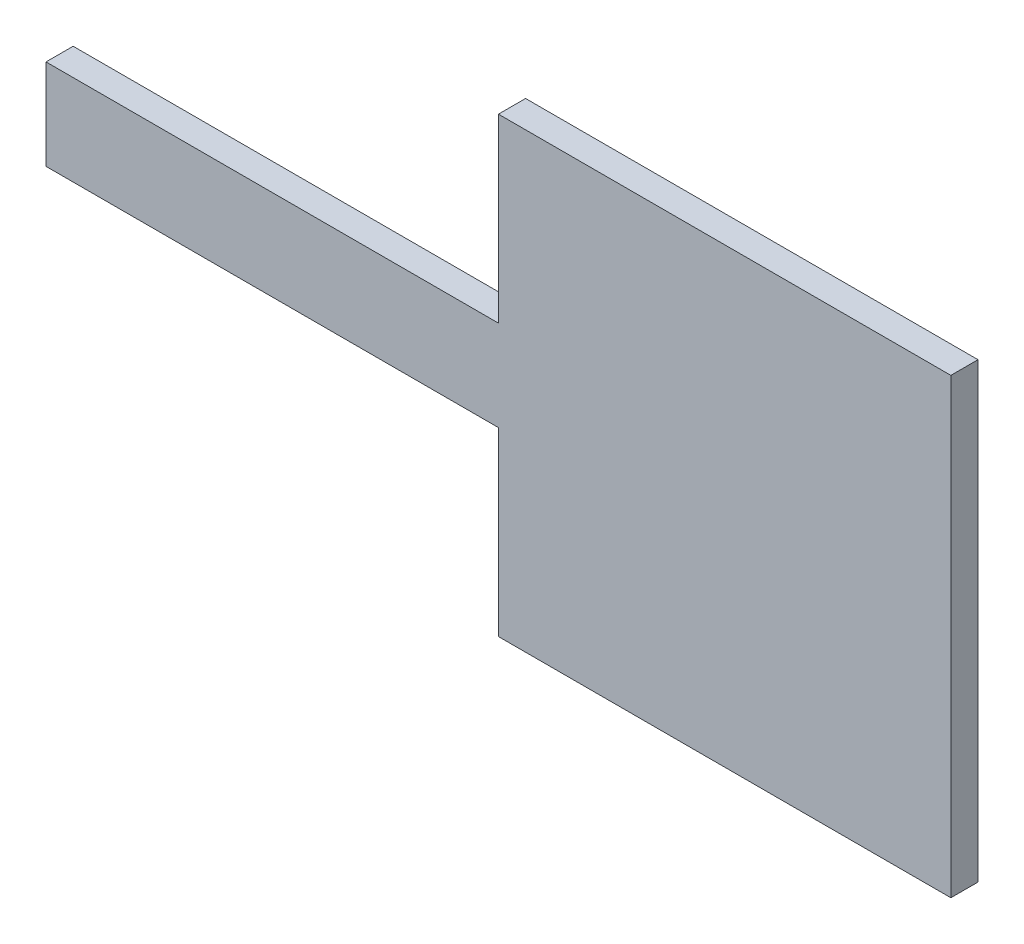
ISO-10303-21;
HEADER;
FILE_DESCRIPTION(('STEP AP214'),'2;1');
FILE_NAME('part.step','',(''),(''),'','','');
FILE_SCHEMA(('AUTOMOTIVE_DESIGN { 1 0 10303 214 1 1 1 1 }'));
ENDSEC;
DATA;
#1=APPLICATION_CONTEXT('core data for automotive mechanical design processes');
#2=APPLICATION_PROTOCOL_DEFINITION('international standard','automotive_design',2000,#1);
#3=PRODUCT_CONTEXT('',#1,'mechanical');
#4=PRODUCT('Part','Part','',(#3));
#5=PRODUCT_RELATED_PRODUCT_CATEGORY('part','',(#4));
#6=PRODUCT_DEFINITION_FORMATION('','',#4);
#7=PRODUCT_DEFINITION_CONTEXT('part definition',#1,'design');
#8=PRODUCT_DEFINITION('design','',#6,#7);
#9=PRODUCT_DEFINITION_SHAPE('','',#8);
#10=(LENGTH_UNIT() NAMED_UNIT(*) SI_UNIT(.MILLI.,.METRE.));
#11=(NAMED_UNIT(*) PLANE_ANGLE_UNIT() SI_UNIT($,.RADIAN.));
#12=(NAMED_UNIT(*) SI_UNIT($,.STERADIAN.) SOLID_ANGLE_UNIT());
#13=UNCERTAINTY_MEASURE_WITH_UNIT(LENGTH_MEASURE(1.E-05),#10,'distance_accuracy_value','');
#14=(GEOMETRIC_REPRESENTATION_CONTEXT(3) GLOBAL_UNCERTAINTY_ASSIGNED_CONTEXT((#13)) GLOBAL_UNIT_ASSIGNED_CONTEXT((#10,
#11,#12)) REPRESENTATION_CONTEXT('',''));
#15=CARTESIAN_POINT('',(0.,0.,0.));
#16=DIRECTION('',(0.,0.,1.));
#17=DIRECTION('',(1.,0.,0.));
#18=AXIS2_PLACEMENT_3D('',#15,#16,#17);
#19=CARTESIAN_POINT('',(-25.,5.00000000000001,3.));
#20=DIRECTION('',(1.,0.,0.));
#21=DIRECTION('',(0.,1.,0.));
#22=AXIS2_PLACEMENT_3D('',#19,#20,#21);
#23=PLANE('',#22);
#24=DIRECTION('',(0.,-1.,0.));
#25=VECTOR('',#24,1.);
#26=CARTESIAN_POINT('',(-25.,5.00000000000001,0.));
#27=LINE('',#26,#25);
#28=CARTESIAN_POINT('',(-25.,25.,0.));
#29=VERTEX_POINT('',#28);
#30=CARTESIAN_POINT('',(-25.,5.00000000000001,0.));
#31=VERTEX_POINT('',#30);
#32=EDGE_CURVE('E134',#29,#31,#27,.T.);
#33=ORIENTED_EDGE('',*,*,#32,.T.);
#34=DIRECTION('',(0.,0.,-1.));
#35=VECTOR('',#34,1.);
#36=CARTESIAN_POINT('',(-25.,5.00000000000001,3.));
#37=LINE('',#36,#35);
#38=CARTESIAN_POINT('',(-25.,5.00000000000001,3.));
#39=VERTEX_POINT('',#38);
#40=EDGE_CURVE('E11',#39,#31,#37,.T.);
#41=ORIENTED_EDGE('',*,*,#40,.F.);
#42=DIRECTION('',(0.,-1.,0.));
#43=VECTOR('',#42,1.);
#44=CARTESIAN_POINT('',(-25.,5.00000000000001,3.));
#45=LINE('',#44,#43);
#46=CARTESIAN_POINT('',(-25.,25.,3.));
#47=VERTEX_POINT('',#46);
#48=EDGE_CURVE('E146',#47,#39,#45,.T.);
#49=ORIENTED_EDGE('',*,*,#48,.F.);
#50=DIRECTION('',(0.,0.,-1.));
#51=VECTOR('',#50,1.);
#52=CARTESIAN_POINT('',(-25.,25.,3.));
#53=LINE('',#52,#51);
#54=EDGE_CURVE('E131',#47,#29,#53,.T.);
#55=ORIENTED_EDGE('',*,*,#54,.T.);
#56=EDGE_LOOP('',(#33,#41,#49,#55));
#57=FACE_BOUND('',#56,.T.);
#58=ADVANCED_FACE('F39',(#57),#23,.F.);
#59=CARTESIAN_POINT('',(-25.,5.00000000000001,3.));
#60=DIRECTION('',(0.,-1.,0.));
#61=DIRECTION('',(1.,0.,0.));
#62=AXIS2_PLACEMENT_3D('',#59,#60,#61);
#63=PLANE('',#62);
#64=DIRECTION('',(-1.,0.,0.));
#65=VECTOR('',#64,1.);
#66=CARTESIAN_POINT('',(-25.,5.00000000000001,0.));
#67=LINE('',#66,#65);
#68=CARTESIAN_POINT('',(-75.,5.,0.));
#69=VERTEX_POINT('',#68);
#70=EDGE_CURVE('E138',#31,#69,#67,.T.);
#71=ORIENTED_EDGE('',*,*,#70,.T.);
#72=DIRECTION('',(0.,0.,-1.));
#73=VECTOR('',#72,1.);
#74=CARTESIAN_POINT('',(-75.,5.,3.));
#75=LINE('',#74,#73);
#76=CARTESIAN_POINT('',(-75.,5.,3.));
#77=VERTEX_POINT('',#76);
#78=EDGE_CURVE('E50',#77,#69,#75,.T.);
#79=ORIENTED_EDGE('',*,*,#78,.F.);
#80=DIRECTION('',(-1.,0.,0.));
#81=VECTOR('',#80,1.);
#82=CARTESIAN_POINT('',(-25.,5.00000000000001,3.));
#83=LINE('',#82,#81);
#84=EDGE_CURVE('E97',#39,#77,#83,.T.);
#85=ORIENTED_EDGE('',*,*,#84,.F.);
#86=ORIENTED_EDGE('',*,*,#40,.T.);
#87=EDGE_LOOP('',(#71,#79,#85,#86));
#88=FACE_BOUND('',#87,.T.);
#89=ADVANCED_FACE('F182',(#88),#63,.F.);
#90=CARTESIAN_POINT('',(-75.,5.,3.));
#91=DIRECTION('',(1.,0.,0.));
#92=DIRECTION('',(0.,0.,-1.));
#93=AXIS2_PLACEMENT_3D('',#90,#91,#92);
#94=PLANE('',#93);
#95=DIRECTION('',(0.,-1.,0.));
#96=VECTOR('',#95,1.);
#97=CARTESIAN_POINT('',(-75.,5.,0.));
#98=LINE('',#97,#96);
#99=CARTESIAN_POINT('',(-75.,-5.,0.));
#100=VERTEX_POINT('',#99);
#101=EDGE_CURVE('E139',#69,#100,#98,.T.);
#102=ORIENTED_EDGE('',*,*,#101,.T.);
#103=DIRECTION('',(0.,0.,-1.));
#104=VECTOR('',#103,1.);
#105=CARTESIAN_POINT('',(-75.,-5.,3.));
#106=LINE('',#105,#104);
#107=CARTESIAN_POINT('',(-75.,-5.,3.));
#108=VERTEX_POINT('',#107);
#109=EDGE_CURVE('E157',#108,#100,#106,.T.);
#110=ORIENTED_EDGE('',*,*,#109,.F.);
#111=DIRECTION('',(0.,-1.,0.));
#112=VECTOR('',#111,1.);
#113=CARTESIAN_POINT('',(-75.,5.,3.));
#114=LINE('',#113,#112);
#115=EDGE_CURVE('E162',#77,#108,#114,.T.);
#116=ORIENTED_EDGE('',*,*,#115,.F.);
#117=ORIENTED_EDGE('',*,*,#78,.T.);
#118=EDGE_LOOP('',(#102,#110,#116,#117));
#119=FACE_BOUND('',#118,.T.);
#120=ADVANCED_FACE('F165',(#119),#94,.F.);
#121=CARTESIAN_POINT('',(-75.,-5.,3.));
#122=DIRECTION('',(0.,1.,0.));
#123=DIRECTION('',(-1.,0.,0.));
#124=AXIS2_PLACEMENT_3D('',#121,#122,#123);
#125=PLANE('',#124);
#126=DIRECTION('',(1.,0.,0.));
#127=VECTOR('',#126,1.);
#128=CARTESIAN_POINT('',(-75.,-5.,0.));
#129=LINE('',#128,#127);
#130=CARTESIAN_POINT('',(-25.,-5.00000000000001,0.));
#131=VERTEX_POINT('',#130);
#132=EDGE_CURVE('E145',#100,#131,#129,.T.);
#133=ORIENTED_EDGE('',*,*,#132,.T.);
#134=DIRECTION('',(0.,0.,-1.));
#135=VECTOR('',#134,1.);
#136=CARTESIAN_POINT('',(-25.,-5.00000000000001,3.));
#137=LINE('',#136,#135);
#138=CARTESIAN_POINT('',(-25.,-5.00000000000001,3.));
#139=VERTEX_POINT('',#138);
#140=EDGE_CURVE('E151',#139,#131,#137,.T.);
#141=ORIENTED_EDGE('',*,*,#140,.F.);
#142=DIRECTION('',(1.,0.,0.));
#143=VECTOR('',#142,1.);
#144=CARTESIAN_POINT('',(-75.,-5.,3.));
#145=LINE('',#144,#143);
#146=EDGE_CURVE('E176',#108,#139,#145,.T.);
#147=ORIENTED_EDGE('',*,*,#146,.F.);
#148=ORIENTED_EDGE('',*,*,#109,.T.);
#149=EDGE_LOOP('',(#133,#141,#147,#148));
#150=FACE_BOUND('',#149,.T.);
#151=ADVANCED_FACE('F175',(#150),#125,.F.);
#152=CARTESIAN_POINT('',(-25.,-25.,3.));
#153=DIRECTION('',(1.,0.,0.));
#154=DIRECTION('',(0.,1.,0.));
#155=AXIS2_PLACEMENT_3D('',#152,#153,#154);
#156=PLANE('',#155);
#157=DIRECTION('',(0.,-1.,0.));
#158=VECTOR('',#157,1.);
#159=CARTESIAN_POINT('',(-25.,-25.,0.));
#160=LINE('',#159,#158);
#161=CARTESIAN_POINT('',(-25.,-25.,0.));
#162=VERTEX_POINT('',#161);
#163=EDGE_CURVE('E143',#131,#162,#160,.T.);
#164=ORIENTED_EDGE('',*,*,#163,.T.);
#165=DIRECTION('',(0.,0.,-1.));
#166=VECTOR('',#165,1.);
#167=CARTESIAN_POINT('',(-25.,-25.,3.));
#168=LINE('',#167,#166);
#169=CARTESIAN_POINT('',(-25.,-25.,3.));
#170=VERTEX_POINT('',#169);
#171=EDGE_CURVE('E128',#170,#162,#168,.T.);
#172=ORIENTED_EDGE('',*,*,#171,.F.);
#173=DIRECTION('',(0.,-1.,0.));
#174=VECTOR('',#173,1.);
#175=CARTESIAN_POINT('',(-25.,-25.,3.));
#176=LINE('',#175,#174);
#177=EDGE_CURVE('E120',#139,#170,#176,.T.);
#178=ORIENTED_EDGE('',*,*,#177,.F.);
#179=ORIENTED_EDGE('',*,*,#140,.T.);
#180=EDGE_LOOP('',(#164,#172,#178,#179));
#181=FACE_BOUND('',#180,.T.);
#182=ADVANCED_FACE('F172',(#181),#156,.F.);
#183=CARTESIAN_POINT('',(25.,-25.,3.));
#184=DIRECTION('',(0.,1.,0.));
#185=DIRECTION('',(-1.,0.,0.));
#186=AXIS2_PLACEMENT_3D('',#183,#184,#185);
#187=PLANE('',#186);
#188=DIRECTION('',(1.,0.,0.));
#189=VECTOR('',#188,1.);
#190=CARTESIAN_POINT('',(25.,-25.,0.));
#191=LINE('',#190,#189);
#192=CARTESIAN_POINT('',(25.,-25.,0.));
#193=VERTEX_POINT('',#192);
#194=EDGE_CURVE('E124',#162,#193,#191,.T.);
#195=ORIENTED_EDGE('',*,*,#194,.T.);
#196=DIRECTION('',(0.,0.,-1.));
#197=VECTOR('',#196,1.);
#198=CARTESIAN_POINT('',(25.,-25.,3.));
#199=LINE('',#198,#197);
#200=CARTESIAN_POINT('',(25.,-25.,3.));
#201=VERTEX_POINT('',#200);
#202=EDGE_CURVE('E122',#201,#193,#199,.T.);
#203=ORIENTED_EDGE('',*,*,#202,.F.);
#204=DIRECTION('',(1.,0.,0.));
#205=VECTOR('',#204,1.);
#206=CARTESIAN_POINT('',(25.,-25.,3.));
#207=LINE('',#206,#205);
#208=EDGE_CURVE('E112',#170,#201,#207,.T.);
#209=ORIENTED_EDGE('',*,*,#208,.F.);
#210=ORIENTED_EDGE('',*,*,#171,.T.);
#211=EDGE_LOOP('',(#195,#203,#209,#210));
#212=FACE_BOUND('',#211,.T.);
#213=ADVANCED_FACE('F121',(#212),#187,.F.);
#214=CARTESIAN_POINT('',(25.,-25.,3.));
#215=DIRECTION('',(-1.,0.,0.));
#216=DIRECTION('',(0.,-1.,0.));
#217=AXIS2_PLACEMENT_3D('',#214,#215,#216);
#218=PLANE('',#217);
#219=DIRECTION('',(0.,1.,0.));
#220=VECTOR('',#219,1.);
#221=CARTESIAN_POINT('',(25.,-25.,0.));
#222=LINE('',#221,#220);
#223=CARTESIAN_POINT('',(25.,25.,0.));
#224=VERTEX_POINT('',#223);
#225=EDGE_CURVE('E84',#193,#224,#222,.T.);
#226=ORIENTED_EDGE('',*,*,#225,.T.);
#227=DIRECTION('',(0.,0.,-1.));
#228=VECTOR('',#227,1.);
#229=CARTESIAN_POINT('',(25.,25.,3.));
#230=LINE('',#229,#228);
#231=CARTESIAN_POINT('',(25.,25.,3.));
#232=VERTEX_POINT('',#231);
#233=EDGE_CURVE('E130',#232,#224,#230,.T.);
#234=ORIENTED_EDGE('',*,*,#233,.F.);
#235=DIRECTION('',(0.,1.,0.));
#236=VECTOR('',#235,1.);
#237=CARTESIAN_POINT('',(25.,-25.,3.));
#238=LINE('',#237,#236);
#239=EDGE_CURVE('E113',#201,#232,#238,.T.);
#240=ORIENTED_EDGE('',*,*,#239,.F.);
#241=ORIENTED_EDGE('',*,*,#202,.T.);
#242=EDGE_LOOP('',(#226,#234,#240,#241));
#243=FACE_BOUND('',#242,.T.);
#244=ADVANCED_FACE('F129',(#243),#218,.F.);
#245=CARTESIAN_POINT('',(25.,25.,3.));
#246=DIRECTION('',(0.,-1.,0.));
#247=DIRECTION('',(1.,0.,0.));
#248=AXIS2_PLACEMENT_3D('',#245,#246,#247);
#249=PLANE('',#248);
#250=DIRECTION('',(-1.,0.,0.));
#251=VECTOR('',#250,1.);
#252=CARTESIAN_POINT('',(25.,25.,0.));
#253=LINE('',#252,#251);
#254=EDGE_CURVE('E89',#224,#29,#253,.T.);
#255=ORIENTED_EDGE('',*,*,#254,.T.);
#256=ORIENTED_EDGE('',*,*,#54,.F.);
#257=DIRECTION('',(-1.,0.,0.));
#258=VECTOR('',#257,1.);
#259=CARTESIAN_POINT('',(25.,25.,3.));
#260=LINE('',#259,#258);
#261=EDGE_CURVE('E54',#232,#47,#260,.T.);
#262=ORIENTED_EDGE('',*,*,#261,.F.);
#263=ORIENTED_EDGE('',*,*,#233,.T.);
#264=EDGE_LOOP('',(#255,#256,#262,#263));
#265=FACE_BOUND('',#264,.T.);
#266=ADVANCED_FACE('F199',(#265),#249,.F.);
#267=CARTESIAN_POINT('',(0.,0.,3.));
#268=DIRECTION('',(0.,0.,1.));
#269=DIRECTION('',(1.,0.,0.));
#270=AXIS2_PLACEMENT_3D('',#267,#268,#269);
#271=PLANE('',#270);
#272=ORIENTED_EDGE('',*,*,#48,.T.);
#273=ORIENTED_EDGE('',*,*,#84,.T.);
#274=ORIENTED_EDGE('',*,*,#115,.T.);
#275=ORIENTED_EDGE('',*,*,#146,.T.);
#276=ORIENTED_EDGE('',*,*,#177,.T.);
#277=ORIENTED_EDGE('',*,*,#208,.T.);
#278=ORIENTED_EDGE('',*,*,#239,.T.);
#279=ORIENTED_EDGE('',*,*,#261,.T.);
#280=EDGE_LOOP('',(#272,#273,#274,#275,#276,#277,#278,#279));
#281=FACE_BOUND('',#280,.T.);
#282=ADVANCED_FACE('F111',(#281),#271,.T.);
#283=CARTESIAN_POINT('',(0.,0.,0.));
#284=DIRECTION('',(0.,0.,1.));
#285=DIRECTION('',(1.,0.,0.));
#286=AXIS2_PLACEMENT_3D('',#283,#284,#285);
#287=PLANE('',#286);
#288=ORIENTED_EDGE('',*,*,#32,.F.);
#289=ORIENTED_EDGE('',*,*,#254,.F.);
#290=ORIENTED_EDGE('',*,*,#225,.F.);
#291=ORIENTED_EDGE('',*,*,#194,.F.);
#292=ORIENTED_EDGE('',*,*,#163,.F.);
#293=ORIENTED_EDGE('',*,*,#132,.F.);
#294=ORIENTED_EDGE('',*,*,#101,.F.);
#295=ORIENTED_EDGE('',*,*,#70,.F.);
#296=EDGE_LOOP('',(#288,#289,#290,#291,#292,#293,#294,#295));
#297=FACE_BOUND('',#296,.T.);
#298=ADVANCED_FACE('F166',(#297),#287,.F.);
#299=CLOSED_SHELL('',(#58,#89,#120,#151,#182,#213,#244,#266,#282,#298));
#300=MANIFOLD_SOLID_BREP('B2',#299);
#301=ADVANCED_BREP_SHAPE_REPRESENTATION('',(#18,#300),#14);
#302=SHAPE_DEFINITION_REPRESENTATION(#9,#301);
ENDSEC;
END-ISO-10303-21;
